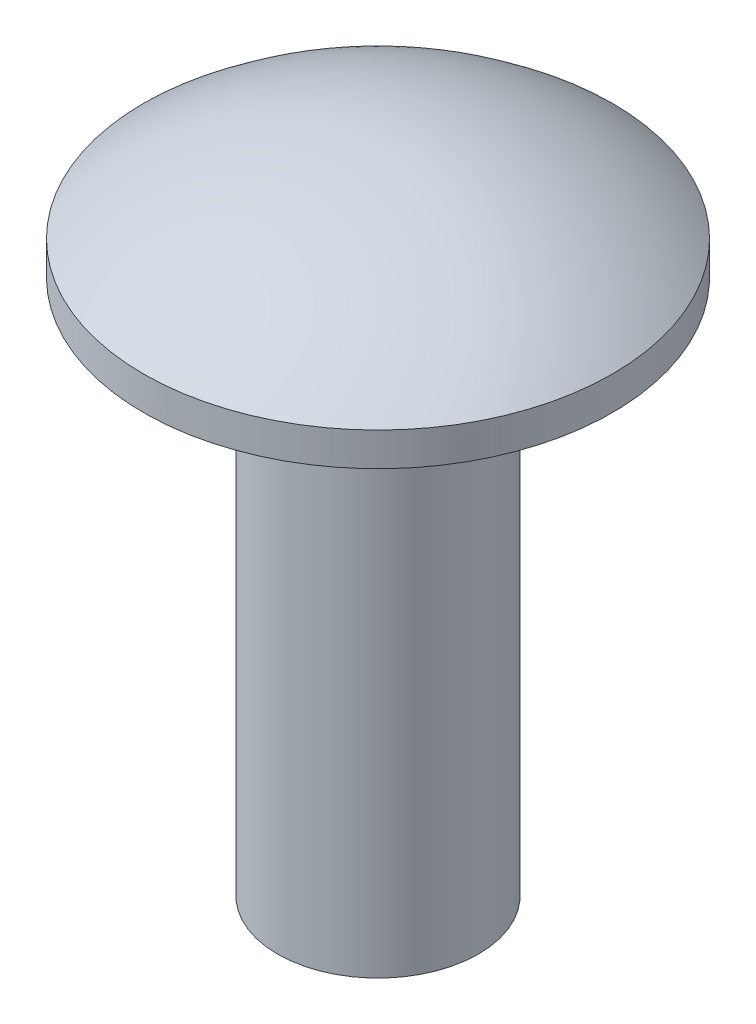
from build123d import *

# Parameters (mm, degrees)
ESQUISSE1_W          = 6.1
ESQUISSE1_H          = 1.4
BASE_EXTRUSION_DEPTH = 3.05
ESQUISSE3_R          = 3
BOSS_EXTRU_1_DEPTH   = 16


with BuildPart() as part:
    # Esquisse1 → Base-Extrusion (new, symmetric)
    with BuildSketch(Plane.XY):
        with Locations((0, 0.7)):
            Rectangle(ESQUISSE1_W, ESQUISSE1_H)
    extrude(amount=BASE_EXTRUSION_DEPTH, both=True)

    # Esquisse2 → Boss.-R_vol.1 (revolve)
    with BuildSketch(Plane.XY, mode=Mode.PRIVATE) as boss_r_vol_1_sk:
        with BuildLine():
            Line((0, 1.4), (7, 1.4))
            Line((7, 1.4), (7, 2.4))
            ThreePointArc((7, 2.4), (3.716517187, 4.256248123), (0, 4.9))
            Line((0, 4.9), (0, 1.4))
        make_face()
    revolve(boss_r_vol_1_sk.sketch.rotate(Axis((0, 13.676408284, 0), (0, -1, 0)), 180), axis=Axis((0, 13.676408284, 0), (0, -1, 0)))

    # Esquisse3 → Boss.-Extru.1 (add)
    with BuildSketch(Plane.XZ.offset(-1.4)):
        with Locations(Location((0, 0, 0), (0, 0, 90))):
            Circle(ESQUISSE3_R)
    extrude(amount=BOSS_EXTRU_1_DEPTH)


solid = part.part
